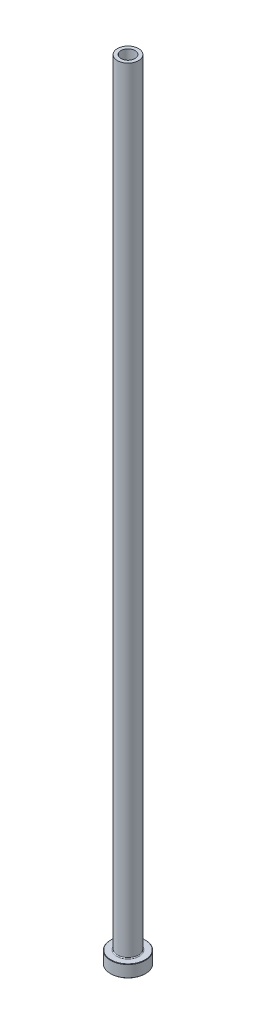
from build123d import *

# Parameters (mm, degrees)
FILLET1_R     = 0.5
CHAMFER1_SIZE = 0.2
CHAMFER3_SIZE = 0.5


with BuildPart() as part:
    # Sketch1 → Revolve1 (revolve)
    with BuildSketch(Plane.XY, mode=Mode.PRIVATE) as revolve1_sk:
        Polygon((-4, 450), (-6, 450), (-6, 7), (-10, 7), (-10, 0), (-4.25, 0), (-4.25, 393), (-4, 405), align=None)
    revolve(revolve1_sk.sketch.rotate(Axis((0, 92.187680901, 0), (0, -1, 0)), 270), axis=Axis((0, 92.187680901, 0), (0, -1, 0)))

    # Fillet1
    fillet1_edges = [part.edges().sort_by_distance(p)[0] for p in [
        (0, 7, -6),
    ]]
    fillet(fillet1_edges, radius=FILLET1_R)

    # Chamfer1
    chamfer1_edges = [part.edges().sort_by_distance(p)[0] for p in [
        (0, 0, -10),
        (0, 7, -10),
    ]]
    chamfer(chamfer1_edges, length=CHAMFER1_SIZE)

    # Chamfer3
    chamfer3_edges = [part.edges().sort_by_distance(p)[0] for p in [
        (0, 0, -4.25),
    ]]
    chamfer(chamfer3_edges, length=CHAMFER3_SIZE)


solid = part.part
